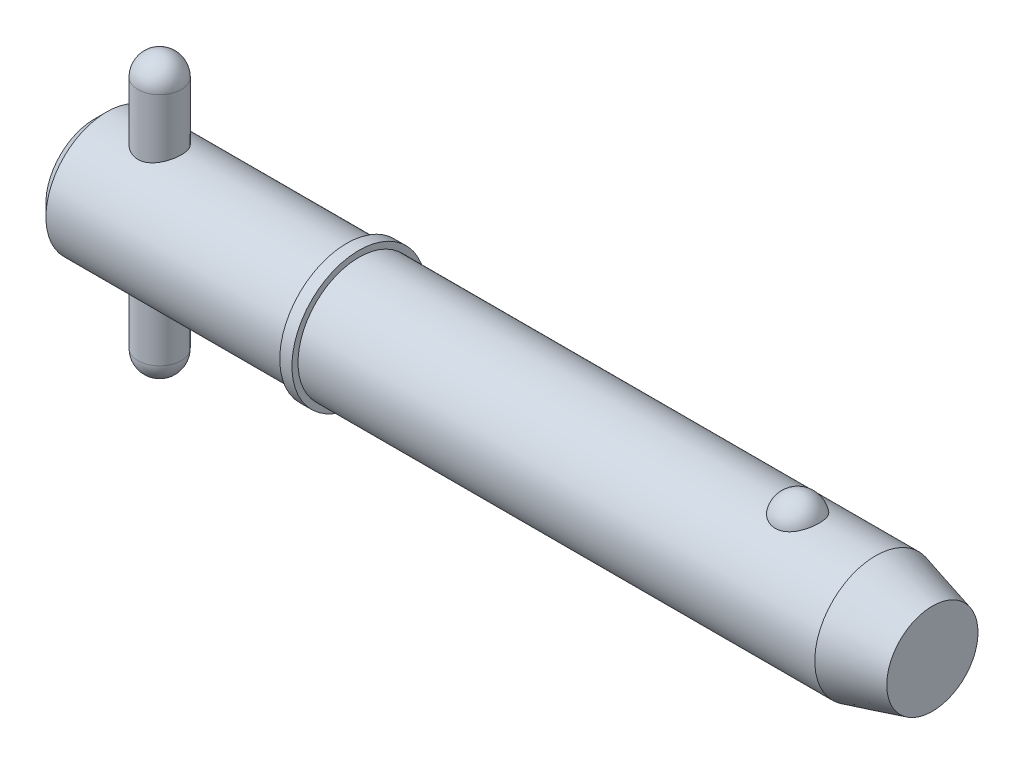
ISO-10303-21;
HEADER;
FILE_DESCRIPTION(('STEP AP214'),'2;1');
FILE_NAME('part.step','',(''),(''),'','','');
FILE_SCHEMA(('AUTOMOTIVE_DESIGN { 1 0 10303 214 1 1 1 1 }'));
ENDSEC;
DATA;
#1=APPLICATION_CONTEXT('core data for automotive mechanical design processes');
#2=APPLICATION_PROTOCOL_DEFINITION('international standard','automotive_design',2000,#1);
#3=PRODUCT_CONTEXT('',#1,'mechanical');
#4=PRODUCT('Part','Part','',(#3));
#5=PRODUCT_RELATED_PRODUCT_CATEGORY('part','',(#4));
#6=PRODUCT_DEFINITION_FORMATION('','',#4);
#7=PRODUCT_DEFINITION_CONTEXT('part definition',#1,'design');
#8=PRODUCT_DEFINITION('design','',#6,#7);
#9=PRODUCT_DEFINITION_SHAPE('','',#8);
#10=(LENGTH_UNIT() NAMED_UNIT(*) SI_UNIT(.MILLI.,.METRE.));
#11=(NAMED_UNIT(*) PLANE_ANGLE_UNIT() SI_UNIT($,.RADIAN.));
#12=(NAMED_UNIT(*) SI_UNIT($,.STERADIAN.) SOLID_ANGLE_UNIT());
#13=UNCERTAINTY_MEASURE_WITH_UNIT(LENGTH_MEASURE(1.E-05),#10,'distance_accuracy_value','');
#14=(GEOMETRIC_REPRESENTATION_CONTEXT(3) GLOBAL_UNCERTAINTY_ASSIGNED_CONTEXT((#13)) GLOBAL_UNIT_ASSIGNED_CONTEXT((#10,
#11,#12)) REPRESENTATION_CONTEXT('',''));
#15=CARTESIAN_POINT('',(0.,0.,0.));
#16=DIRECTION('',(0.,0.,1.));
#17=DIRECTION('',(1.,0.,0.));
#18=AXIS2_PLACEMENT_3D('',#15,#16,#17);
#19=CARTESIAN_POINT('',(5.94,12.7,0.));
#20=DIRECTION('',(0.,-1.,0.));
#21=DIRECTION('',(0.,0.,-1.));
#22=AXIS2_PLACEMENT_3D('',#19,#20,#21);
#23=CYLINDRICAL_SURFACE('',#22,1.98);
#24=CARTESIAN_POINT('',(5.94,-10.72,0.));
#25=DIRECTION('',(0.,-1.,0.));
#26=DIRECTION('',(0.,0.,-1.));
#27=AXIS2_PLACEMENT_3D('',#24,#25,#26);
#28=CIRCLE('',#27,1.98);
#29=CARTESIAN_POINT('',(5.94,-10.72,-1.98));
#30=VERTEX_POINT('',#29);
#31=EDGE_CURVE('P0_E10',#30,#30,#28,.F.);
#32=ORIENTED_EDGE('',*,*,#31,.T.);
#33=EDGE_LOOP('',(#32));
#34=FACE_BOUND('',#33,.T.);
#35=CARTESIAN_POINT('',(5.94,10.72,0.));
#36=DIRECTION('',(0.,-1.,0.));
#37=DIRECTION('',(0.,0.,-1.));
#38=AXIS2_PLACEMENT_3D('',#35,#36,#37);
#39=CIRCLE('',#38,1.98);
#40=CARTESIAN_POINT('',(5.94,10.72,-1.98));
#41=VERTEX_POINT('',#40);
#42=EDGE_CURVE('P0_E21',#41,#41,#39,.T.);
#43=ORIENTED_EDGE('',*,*,#42,.T.);
#44=EDGE_LOOP('',(#43));
#45=FACE_BOUND('',#44,.T.);
#46=ADVANCED_FACE('P0_F14',(#34,#45),#23,.T.);
#47=CARTESIAN_POINT('',(5.94,-10.72,0.));
#48=DIRECTION('',(0.,0.,1.));
#49=DIRECTION('',(1.,0.,0.));
#50=AXIS2_PLACEMENT_3D('',#47,#48,#49);
#51=SPHERICAL_SURFACE('',#50,1.98);
#52=CARTESIAN_POINT('',(5.94,-10.72,0.));
#53=DIRECTION('',(0.,-1.,0.));
#54=DIRECTION('',(0.,0.,-1.));
#55=AXIS2_PLACEMENT_3D('',#52,#53,#54);
#56=SPHERICAL_SURFACE('',#55,1.98);
#57=ORIENTED_EDGE('',*,*,#31,.F.);
#58=EDGE_LOOP('',(#57));
#59=FACE_BOUND('',#58,.T.);
#60=ADVANCED_FACE('P0_F29',(#59),#56,.T.);
#61=CARTESIAN_POINT('',(5.94,10.72,0.));
#62=DIRECTION('',(0.,0.,1.));
#63=DIRECTION('',(1.,0.,0.));
#64=AXIS2_PLACEMENT_3D('',#61,#62,#63);
#65=SPHERICAL_SURFACE('',#64,1.98);
#66=CARTESIAN_POINT('',(5.94,10.72,0.));
#67=DIRECTION('',(0.,-1.,0.));
#68=DIRECTION('',(0.,0.,-1.));
#69=AXIS2_PLACEMENT_3D('',#66,#67,#68);
#70=SPHERICAL_SURFACE('',#69,1.98);
#71=ORIENTED_EDGE('',*,*,#42,.F.);
#72=EDGE_LOOP('',(#71));
#73=FACE_BOUND('',#72,.T.);
#74=ADVANCED_FACE('P0_F16',(#73),#70,.T.);
#75=CLOSED_SHELL('',(#46,#60,#74));
#76=MANIFOLD_SOLID_BREP('P0_B1',#75);
#77=CARTESIAN_POINT('',(0.,0.,0.));
#78=DIRECTION('',(1.,0.,0.));
#79=DIRECTION('',(0.,0.,-1.));
#80=AXIS2_PLACEMENT_3D('',#77,#78,#79);
#81=CYLINDRICAL_SURFACE('',#80,5.555);
#82=CARTESIAN_POINT('',(71.3171144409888,0.,0.));
#83=DIRECTION('',(1.,0.,0.));
#84=DIRECTION('',(0.,0.,-1.));
#85=AXIS2_PLACEMENT_3D('',#82,#83,#84);
#86=CIRCLE('',#85,5.555);
#87=CARTESIAN_POINT('',(71.3171144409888,0.,-5.555));
#88=VERTEX_POINT('',#87);
#89=EDGE_CURVE('P1_E81',#88,#88,#86,.T.);
#90=ORIENTED_EDGE('',*,*,#89,.F.);
#91=EDGE_LOOP('',(#90));
#92=FACE_BOUND('',#91,.T.);
#93=CARTESIAN_POINT('',(24.13,0.,0.));
#94=DIRECTION('',(1.,0.,0.));
#95=DIRECTION('',(0.,0.,-1.));
#96=AXIS2_PLACEMENT_3D('',#93,#94,#95);
#97=CIRCLE('',#96,5.555);
#98=CARTESIAN_POINT('',(24.13,0.,-5.555));
#99=VERTEX_POINT('',#98);
#100=EDGE_CURVE('P1_E85',#99,#99,#97,.T.);
#101=ORIENTED_EDGE('',*,*,#100,.T.);
#102=EDGE_LOOP('',(#101));
#103=FACE_BOUND('',#102,.T.);
#104=CARTESIAN_POINT('',(64.1986264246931,5.16741224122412,2.03859650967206));
#105=CARTESIAN_POINT('',(64.0929492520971,5.16740893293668,2.03859990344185));
#106=CARTESIAN_POINT('',(63.98729894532,5.17079470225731,2.03008306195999));
#107=CARTESIAN_POINT('',(63.7791419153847,5.18392795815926,1.99630721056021));
#108=CARTESIAN_POINT('',(63.6766344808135,5.19367399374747,1.97105201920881));
#109=CARTESIAN_POINT('',(63.4777710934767,5.21839168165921,1.90463997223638));
#110=CARTESIAN_POINT('',(63.3814064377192,5.23335573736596,1.86350622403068));
#111=CARTESIAN_POINT('',(63.1970804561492,5.26688076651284,1.76652592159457));
#112=CARTESIAN_POINT('',(63.1091207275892,5.28544242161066,1.71067657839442));
#113=CARTESIAN_POINT('',(62.941265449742,5.32479845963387,1.58399959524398));
#114=CARTESIAN_POINT('',(62.8616656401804,5.34564089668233,1.5127954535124));
#115=CARTESIAN_POINT('',(62.7151290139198,5.38697258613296,1.3582858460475));
#116=CARTESIAN_POINT('',(62.648194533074,5.40746177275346,1.27497815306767));
#117=CARTESIAN_POINT('',(62.5256103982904,5.44694508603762,1.09440293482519));
#118=CARTESIAN_POINT('',(62.4705989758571,5.46583143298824,0.996677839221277));
#119=CARTESIAN_POINT('',(62.3769376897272,5.49908030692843,0.79296193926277));
#120=CARTESIAN_POINT('',(62.3382894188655,5.513442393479,0.686970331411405));
#121=CARTESIAN_POINT('',(62.2776807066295,5.536358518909,0.468019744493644));
#122=CARTESIAN_POINT('',(62.2559725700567,5.54482455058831,0.354981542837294));
#123=CARTESIAN_POINT('',(62.2306362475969,5.55473324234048,0.126595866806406));
#124=CARTESIAN_POINT('',(62.2270077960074,5.55617600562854,0.0112484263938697));
#125=CARTESIAN_POINT('',(62.2378817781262,5.55189984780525,-0.218011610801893));
#126=CARTESIAN_POINT('',(62.2523151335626,5.54620821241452,-0.331928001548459));
#127=CARTESIAN_POINT('',(62.298903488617,5.52828920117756,-0.555544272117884));
#128=CARTESIAN_POINT('',(62.3310588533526,5.51606169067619,-0.665244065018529));
#129=CARTESIAN_POINT('',(62.4124883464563,5.48630779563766,-0.877469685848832));
#130=CARTESIAN_POINT('',(62.4617816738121,5.4687754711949,-0.97998731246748));
#131=CARTESIAN_POINT('',(62.5764785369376,5.43024700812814,-1.1748697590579));
#132=CARTESIAN_POINT('',(62.6418831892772,5.4092506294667,-1.26723387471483));
#133=CARTESIAN_POINT('',(62.7875712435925,5.36600927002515,-1.43940133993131));
#134=CARTESIAN_POINT('',(62.8678859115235,5.34376173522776,-1.51917763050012));
#135=CARTESIAN_POINT('',(63.0414520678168,5.30057971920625,-1.66360338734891));
#136=CARTESIAN_POINT('',(63.134702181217,5.27964509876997,-1.72825445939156));
#137=CARTESIAN_POINT('',(63.3293939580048,5.24205250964,-1.83909478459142));
#138=CARTESIAN_POINT('',(63.4305900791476,5.22530519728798,-1.88568407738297));
#139=CARTESIAN_POINT('',(63.6401552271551,5.19750919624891,-1.96100802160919));
#140=CARTESIAN_POINT('',(63.7485215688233,5.1864583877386,-1.98974931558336));
#141=CARTESIAN_POINT('',(63.9634989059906,5.17184410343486,-2.02742262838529));
#142=CARTESIAN_POINT('',(64.069925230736,5.1679328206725,-2.03727608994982));
#143=CARTESIAN_POINT('',(64.2829925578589,5.16698995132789,-2.03966777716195));
#144=CARTESIAN_POINT('',(64.3896335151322,5.16995704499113,-2.03220932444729));
#145=CARTESIAN_POINT('',(64.5967730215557,5.18222383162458,-2.00071170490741));
#146=CARTESIAN_POINT('',(64.6973599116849,5.19133213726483,-1.97717337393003));
#147=CARTESIAN_POINT('',(64.8930141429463,5.21467637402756,-1.91475248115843));
#148=CARTESIAN_POINT('',(64.9880810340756,5.22891272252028,-1.8758686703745));
#149=CARTESIAN_POINT('',(65.1723711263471,5.26137066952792,-1.78282713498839));
#150=CARTESIAN_POINT('',(65.2614190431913,5.27967329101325,-1.72835124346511));
#151=CARTESIAN_POINT('',(65.4292880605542,5.31817411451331,-1.60597483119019));
#152=CARTESIAN_POINT('',(65.5081068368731,5.33837274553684,-1.53807126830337));
#153=CARTESIAN_POINT('',(65.6575156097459,5.37968287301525,-1.38688970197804));
#154=CARTESIAN_POINT('',(65.7275058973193,5.40079011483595,-1.30301744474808));
#155=CARTESIAN_POINT('',(65.8530125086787,5.44074401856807,-1.12458170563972));
#156=CARTESIAN_POINT('',(65.9085262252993,5.4595902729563,-1.03001630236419));
#157=CARTESIAN_POINT('',(66.0055507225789,5.49369849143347,-0.829439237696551));
#158=CARTESIAN_POINT('',(66.0465483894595,5.50882422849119,-0.723155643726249));
#159=CARTESIAN_POINT('',(66.1111250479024,5.53310911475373,-0.504772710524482));
#160=CARTESIAN_POINT('',(66.1347036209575,5.54226812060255,-0.392673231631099));
#161=CARTESIAN_POINT('',(66.164013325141,5.55370358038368,-0.165459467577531));
#162=CARTESIAN_POINT('',(66.1696884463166,5.55595843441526,-0.0503368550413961));
#163=CARTESIAN_POINT('',(66.162916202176,5.55329317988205,0.179288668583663));
#164=CARTESIAN_POINT('',(66.1504690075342,5.54837313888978,0.293791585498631));
#165=CARTESIAN_POINT('',(66.1077798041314,5.53189037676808,0.51852641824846));
#166=CARTESIAN_POINT('',(66.077598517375,5.5203503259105,0.628771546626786));
#167=CARTESIAN_POINT('',(66.0000962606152,5.49182453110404,0.842318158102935));
#168=CARTESIAN_POINT('',(65.9527743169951,5.47483847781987,0.945619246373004));
#169=CARTESIAN_POINT('',(65.8417204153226,5.43710633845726,1.14281571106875));
#170=CARTESIAN_POINT('',(65.777921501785,5.41634501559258,1.23667048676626));
#171=CARTESIAN_POINT('',(65.6353577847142,5.37334572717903,1.41185243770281));
#172=CARTESIAN_POINT('',(65.5565932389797,5.35110778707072,1.4931798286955));
#173=CARTESIAN_POINT('',(65.3864234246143,5.30779474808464,1.64049162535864));
#174=CARTESIAN_POINT('',(65.2951002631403,5.28671324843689,1.7065687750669));
#175=CARTESIAN_POINT('',(65.1017390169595,5.24804852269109,1.82201372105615));
#176=CARTESIAN_POINT('',(64.9997005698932,5.23046541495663,1.87138095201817));
#177=CARTESIAN_POINT('',(64.7836187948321,5.20042692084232,1.95335298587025));
#178=CARTESIAN_POINT('',(64.669260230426,5.18820192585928,1.98521734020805));
#179=CARTESIAN_POINT('',(64.4361307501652,5.17169804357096,2.02783294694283));
#180=CARTESIAN_POINT('',(64.3173616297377,5.16741595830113,2.03859269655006));
#181=CARTESIAN_POINT('',(64.1986264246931,5.16741224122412,2.03859650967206));
#182=B_SPLINE_CURVE_WITH_KNOTS('',3,(#104,#105,#106,#107,#108,#109,#110,#111,#112,#113,#114,
#115,#116,#117,#118,#119,#120,#121,#122,#123,#124,#125,#126,#127,#128,#129,#130,#131,#132,#133,
#134,#135,#136,#137,#138,#139,#140,#141,#142,#143,#144,#145,#146,#147,#148,#149,#150,#151,#152,
#153,#154,#155,#156,#157,#158,#159,#160,#161,#162,#163,#164,#165,#166,#167,#168,#169,#170,#171,
#172,#173,#174,#175,#176,#177,#178,#179,#180,#181),.UNSPECIFIED.,.T.,.F.,(4,2,2,2,2,2,2,2,2,2,2,
2,2,2,2,2,2,2,2,2,2,2,2,2,2,2,2,2,2,2,2,2,2,2,2,2,2,2,4),(0.,0.316595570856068,
0.633118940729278,0.949183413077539,1.26530783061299,1.59030762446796,1.91536729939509,
2.25495824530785,2.59458224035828,2.93917283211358,3.28375835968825,3.62703002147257,
3.97030875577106,4.31397329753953,4.657661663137,5.00207904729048,5.34645984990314,
5.68270547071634,6.01882587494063,6.33808403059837,6.65728093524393,6.96696376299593,
7.27667180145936,7.59321535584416,7.90983070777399,8.24210387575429,8.5744368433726,
8.9175589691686,9.26068933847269,9.60489211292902,9.94909164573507,10.2921194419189,
10.6351667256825,10.9796305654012,11.3240884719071,11.6663928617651,12.0087088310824,
12.3645679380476,12.7202837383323),.UNSPECIFIED.);
#183=CARTESIAN_POINT('',(64.1986264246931,5.16741224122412,2.03859650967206));
#184=VERTEX_POINT('',#183);
#185=EDGE_CURVE('P1_E35',#184,#184,#182,.T.);
#186=ORIENTED_EDGE('',*,*,#185,.T.);
#187=EDGE_LOOP('',(#186));
#188=FACE_BOUND('',#187,.T.);
#189=ADVANCED_FACE('P1_F13',(#92,#103,#188),#81,.T.);
#190=CARTESIAN_POINT('',(0.,0.,0.));
#191=DIRECTION('',(-1.,0.,0.));
#192=DIRECTION('',(0.,0.,1.));
#193=AXIS2_PLACEMENT_3D('',#190,#191,#192);
#194=PLANE('',#193);
#195=CARTESIAN_POINT('',(0.,0.,0.));
#196=DIRECTION('',(1.,0.,0.));
#197=DIRECTION('',(0.,0.,-1.));
#198=AXIS2_PLACEMENT_3D('',#195,#196,#197);
#199=CIRCLE('',#198,4.444);
#200=CARTESIAN_POINT('',(0.,0.,-4.444));
#201=VERTEX_POINT('',#200);
#202=EDGE_CURVE('P1_E9',#201,#201,#199,.T.);
#203=ORIENTED_EDGE('',*,*,#202,.F.);
#204=EDGE_LOOP('',(#203));
#205=FACE_BOUND('',#204,.T.);
#206=ADVANCED_FACE('P1_F15',(#205),#194,.T.);
#207=CARTESIAN_POINT('',(1.111,0.,0.));
#208=DIRECTION('',(1.,0.,0.));
#209=DIRECTION('',(0.,0.,-1.));
#210=AXIS2_PLACEMENT_3D('',#207,#208,#209);
#211=CONICAL_SURFACE('',#210,5.555,0.78539816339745);
#212=ORIENTED_EDGE('',*,*,#202,.T.);
#213=EDGE_LOOP('',(#212));
#214=FACE_BOUND('',#213,.T.);
#215=CARTESIAN_POINT('',(1.111,0.,0.));
#216=DIRECTION('',(1.,0.,0.));
#217=DIRECTION('',(0.,0.,-1.));
#218=AXIS2_PLACEMENT_3D('',#215,#216,#217);
#219=CIRCLE('',#218,5.555);
#220=CARTESIAN_POINT('',(1.111,0.,-5.555));
#221=VERTEX_POINT('',#220);
#222=EDGE_CURVE('P1_E26',#221,#221,#219,.T.);
#223=ORIENTED_EDGE('',*,*,#222,.F.);
#224=EDGE_LOOP('',(#223));
#225=FACE_BOUND('',#224,.T.);
#226=ADVANCED_FACE('P1_F77',(#214,#225),#211,.T.);
#227=CARTESIAN_POINT('',(0.,0.,0.));
#228=DIRECTION('',(1.,0.,0.));
#229=DIRECTION('',(0.,0.,-1.));
#230=AXIS2_PLACEMENT_3D('',#227,#228,#229);
#231=CYLINDRICAL_SURFACE('',#230,5.555);
#232=CARTESIAN_POINT('',(5.94,-5.19014691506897,1.98));
#233=CARTESIAN_POINT('',(5.83264687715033,-5.19014494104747,1.98000226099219));
#234=CARTESIAN_POINT('',(5.7253094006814,-5.19351395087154,1.97123988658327));
#235=CARTESIAN_POINT('',(5.51384517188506,-5.20654291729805,1.93656219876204));
#236=CARTESIAN_POINT('',(5.40971858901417,-5.21620320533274,1.91064598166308));
#237=CARTESIAN_POINT('',(5.20778082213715,-5.24058443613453,1.84271148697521));
#238=CARTESIAN_POINT('',(5.10995634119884,-5.25529427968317,1.80072850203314));
#239=CARTESIAN_POINT('',(4.92270352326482,-5.28810012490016,1.70197537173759));
#240=CARTESIAN_POINT('',(4.83327743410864,-5.3061970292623,1.64520128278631));
#241=CARTESIAN_POINT('',(4.66135184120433,-5.34464714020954,1.51575187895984));
#242=CARTESIAN_POINT('',(4.57928277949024,-5.36506222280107,1.44252311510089));
#243=CARTESIAN_POINT('',(4.42829115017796,-5.40532920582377,1.28342047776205));
#244=CARTESIAN_POINT('',(4.35937105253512,-5.42518099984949,1.19754423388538));
#245=CARTESIAN_POINT('',(4.23461605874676,-5.46281133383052,1.01237205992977));
#246=CARTESIAN_POINT('',(4.17924129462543,-5.48050875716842,0.912748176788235));
#247=CARTESIAN_POINT('',(4.0862117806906,-5.51109938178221,0.70485824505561));
#248=CARTESIAN_POINT('',(4.0485515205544,-5.52399407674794,0.596594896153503));
#249=CARTESIAN_POINT('',(3.99350662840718,-5.54308759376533,0.379019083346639));
#250=CARTESIAN_POINT('',(3.97538263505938,-5.54952987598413,0.269915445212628));
#251=CARTESIAN_POINT('',(3.95756405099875,-5.55586205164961,0.0500378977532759));
#252=CARTESIAN_POINT('',(3.95786404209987,-5.55575387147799,-0.060735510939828));
#253=CARTESIAN_POINT('',(3.97643665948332,-5.54915684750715,-0.275539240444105));
#254=CARTESIAN_POINT('',(3.99390415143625,-5.54295384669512,-0.379649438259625));
#255=CARTESIAN_POINT('',(4.0449721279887,-5.52523170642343,-0.583350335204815));
#256=CARTESIAN_POINT('',(4.07857373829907,-5.51371219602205,-0.682940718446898));
#257=CARTESIAN_POINT('',(4.16137312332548,-5.4863099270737,-0.876423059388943));
#258=CARTESIAN_POINT('',(4.2107826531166,-5.47036834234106,-0.970215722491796));
#259=CARTESIAN_POINT('',(4.32361427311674,-5.43575653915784,-1.1484017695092));
#260=CARTESIAN_POINT('',(4.38704062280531,-5.41708549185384,-1.23279228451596));
#261=CARTESIAN_POINT('',(4.53006791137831,-5.37778429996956,-1.39454579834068));
#262=CARTESIAN_POINT('',(4.61035105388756,-5.35710277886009,-1.4712940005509));
#263=CARTESIAN_POINT('',(4.78279835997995,-5.31692766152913,-1.6104545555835));
#264=CARTESIAN_POINT('',(4.874964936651,-5.29743430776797,-1.67286398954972));
#265=CARTESIAN_POINT('',(5.07076688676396,-5.26153775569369,-1.78259698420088));
#266=CARTESIAN_POINT('',(5.17458163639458,-5.24519780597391,-1.8296227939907));
#267=CARTESIAN_POINT('',(5.38938990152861,-5.21818744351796,-1.90530278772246));
#268=CARTESIAN_POINT('',(5.50037985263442,-5.20751423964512,-1.93396601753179));
#269=CARTESIAN_POINT('',(5.72036376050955,-5.19369176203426,-1.97077654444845));
#270=CARTESIAN_POINT('',(5.82917370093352,-5.19018851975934,-1.97989015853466));
#271=CARTESIAN_POINT('',(6.04680100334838,-5.19010609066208,-1.98010779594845));
#272=CARTESIAN_POINT('',(6.15561835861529,-5.19352540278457,-1.97121572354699));
#273=CARTESIAN_POINT('',(6.36548036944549,-5.20654623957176,-1.93654727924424));
#274=CARTESIAN_POINT('',(6.46666051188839,-5.21588705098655,-1.91148218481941));
#275=CARTESIAN_POINT('',(6.66334537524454,-5.23939939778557,-1.84605494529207));
#276=CARTESIAN_POINT('',(6.75884899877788,-5.25357186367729,-1.8056898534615));
#277=CARTESIAN_POINT('',(6.94517989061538,-5.28576258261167,-1.70921153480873));
#278=CARTESIAN_POINT('',(7.03572661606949,-5.30389804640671,-1.65259670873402));
#279=CARTESIAN_POINT('',(7.20638087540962,-5.34176077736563,-1.52577523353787));
#280=CARTESIAN_POINT('',(7.28648490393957,-5.36148857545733,-1.45556404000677));
#281=CARTESIAN_POINT('',(7.43864697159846,-5.40165494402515,-1.2988614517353));
#282=CARTESIAN_POINT('',(7.50999887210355,-5.42207106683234,-1.21167640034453));
#283=CARTESIAN_POINT('',(7.63712639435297,-5.46023601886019,-1.026066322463));
#284=CARTESIAN_POINT('',(7.69290228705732,-5.47798489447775,-0.927641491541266));
#285=CARTESIAN_POINT('',(7.78684673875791,-5.50876590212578,-0.722633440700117));
#286=CARTESIAN_POINT('',(7.82510508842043,-5.52182201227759,-0.616095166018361));
#287=CARTESIAN_POINT('',(7.88297051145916,-5.54184206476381,-0.397530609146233));
#288=CARTESIAN_POINT('',(7.90258540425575,-5.5488085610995,-0.285506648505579));
#289=CARTESIAN_POINT('',(7.9218262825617,-5.55564472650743,-0.065566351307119));
#290=CARTESIAN_POINT('',(7.92245987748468,-5.55587212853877,0.0422515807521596));
#291=CARTESIAN_POINT('',(7.90626329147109,-5.55011340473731,0.256387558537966));
#292=CARTESIAN_POINT('',(7.88943488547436,-5.54412791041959,0.362705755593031));
#293=CARTESIAN_POINT('',(7.83948457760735,-5.52676548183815,0.568649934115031));
#294=CARTESIAN_POINT('',(7.8067003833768,-5.51550046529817,0.668367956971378));
#295=CARTESIAN_POINT('',(7.72609369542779,-5.48874437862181,0.860911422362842));
#296=CARTESIAN_POINT('',(7.67826838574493,-5.47325251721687,0.953735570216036));
#297=CARTESIAN_POINT('',(7.56675024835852,-5.43884382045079,1.13391068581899));
#298=CARTESIAN_POINT('',(7.50249968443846,-5.41981485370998,1.22089468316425));
#299=CARTESIAN_POINT('',(7.36086495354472,-5.38069275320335,1.38316665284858));
#300=CARTESIAN_POINT('',(7.28347630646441,-5.36059925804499,1.45845061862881));
#301=CARTESIAN_POINT('',(7.11347587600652,-5.32048380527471,1.59876646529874));
#302=CARTESIAN_POINT('',(7.02032386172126,-5.30050854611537,1.66315951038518));
#303=CARTESIAN_POINT('',(6.82388804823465,-5.26398994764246,1.77536801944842));
#304=CARTESIAN_POINT('',(6.7206049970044,-5.24744635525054,1.82318470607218));
#305=CARTESIAN_POINT('',(6.50639706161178,-5.21987969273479,1.90068230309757));
#306=CARTESIAN_POINT('',(6.3954529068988,-5.20887116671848,1.93031547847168));
#307=CARTESIAN_POINT('',(6.16966522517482,-5.19400760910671,1.96996824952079));
#308=CARTESIAN_POINT('',(6.05482366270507,-5.19014902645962,1.97999758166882));
#309=CARTESIAN_POINT('',(5.94,-5.19014691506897,1.98));
#310=B_SPLINE_CURVE_WITH_KNOTS('',3,(#232,#233,#234,#235,#236,#237,#238,#239,#240,#241,#242,
#243,#244,#245,#246,#247,#248,#249,#250,#251,#252,#253,#254,#255,#256,#257,#258,#259,#260,#261,
#262,#263,#264,#265,#266,#267,#268,#269,#270,#271,#272,#273,#274,#275,#276,#277,#278,#279,#280,
#281,#282,#283,#284,#285,#286,#287,#288,#289,#290,#291,#292,#293,#294,#295,#296,#297,#298,#299,
#300,#301,#302,#303,#304,#305,#306,#307,#308,#309),.UNSPECIFIED.,.T.,.F.,(4,2,2,2,2,2,2,2,2,2,2,
2,2,2,2,2,2,2,2,2,2,2,2,2,2,2,2,2,2,2,2,2,2,2,2,2,2,2,4),(0.,0.321632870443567,
0.643282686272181,0.964229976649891,1.28526292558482,1.61937087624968,1.9535415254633,
2.29784481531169,2.64204093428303,2.97269632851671,3.30325448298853,3.61901541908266,
3.93479838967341,4.25500220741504,4.57530346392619,4.91268648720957,5.25013812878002,
5.59378026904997,5.93725299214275,6.26331481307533,6.58930593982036,6.90185604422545,
7.21446637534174,7.53801472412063,7.86167140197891,8.20353561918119,8.54539388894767,
8.88547970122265,9.22542281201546,9.54728637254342,9.86911722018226,10.1844146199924,
10.4997710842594,10.827730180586,11.1558013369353,11.499115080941,11.8424034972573,
12.1865892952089,12.5306041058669),.UNSPECIFIED.);
#311=CARTESIAN_POINT('',(5.94,-5.19014691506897,1.98));
#312=VERTEX_POINT('',#311);
#313=EDGE_CURVE('P1_E17',#312,#312,#310,.T.);
#314=ORIENTED_EDGE('',*,*,#313,.F.);
#315=EDGE_LOOP('',(#314));
#316=FACE_BOUND('',#315,.T.);
#317=CARTESIAN_POINT('',(5.94,5.19014691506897,1.98));
#318=CARTESIAN_POINT('',(6.04735312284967,5.19014494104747,1.98000226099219));
#319=CARTESIAN_POINT('',(6.1546905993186,5.19351395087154,1.97123988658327));
#320=CARTESIAN_POINT('',(6.36615482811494,5.20654291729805,1.93656219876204));
#321=CARTESIAN_POINT('',(6.47028141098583,5.21620320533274,1.91064598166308));
#322=CARTESIAN_POINT('',(6.67221917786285,5.24058443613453,1.84271148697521));
#323=CARTESIAN_POINT('',(6.77004365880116,5.25529427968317,1.80072850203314));
#324=CARTESIAN_POINT('',(6.95729647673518,5.28810012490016,1.70197537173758));
#325=CARTESIAN_POINT('',(7.04672256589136,5.3061970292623,1.64520128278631));
#326=CARTESIAN_POINT('',(7.21864815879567,5.34464714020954,1.51575187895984));
#327=CARTESIAN_POINT('',(7.30071722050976,5.36506222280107,1.44252311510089));
#328=CARTESIAN_POINT('',(7.45170884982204,5.40532920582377,1.28342047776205));
#329=CARTESIAN_POINT('',(7.52062894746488,5.42518099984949,1.19754423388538));
#330=CARTESIAN_POINT('',(7.64538394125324,5.46281133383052,1.01237205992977));
#331=CARTESIAN_POINT('',(7.70075870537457,5.48050875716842,0.912748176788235));
#332=CARTESIAN_POINT('',(7.7937882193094,5.51109938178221,0.704858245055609));
#333=CARTESIAN_POINT('',(7.8314484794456,5.52399407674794,0.596594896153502));
#334=CARTESIAN_POINT('',(7.88649337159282,5.54308759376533,0.379019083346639));
#335=CARTESIAN_POINT('',(7.90461736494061,5.54952987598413,0.269915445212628));
#336=CARTESIAN_POINT('',(7.92243594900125,5.55586205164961,0.0500378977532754));
#337=CARTESIAN_POINT('',(7.92213595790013,5.55575387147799,-0.0607355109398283));
#338=CARTESIAN_POINT('',(7.90356334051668,5.54915684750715,-0.275539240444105));
#339=CARTESIAN_POINT('',(7.88609584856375,5.54295384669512,-0.379649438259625));
#340=CARTESIAN_POINT('',(7.8350278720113,5.52523170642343,-0.583350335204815));
#341=CARTESIAN_POINT('',(7.80142626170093,5.51371219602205,-0.682940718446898));
#342=CARTESIAN_POINT('',(7.71862687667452,5.4863099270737,-0.876423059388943));
#343=CARTESIAN_POINT('',(7.6692173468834,5.47036834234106,-0.970215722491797));
#344=CARTESIAN_POINT('',(7.55638572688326,5.43575653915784,-1.1484017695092));
#345=CARTESIAN_POINT('',(7.49295937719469,5.41708549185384,-1.23279228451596));
#346=CARTESIAN_POINT('',(7.34993208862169,5.37778429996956,-1.39454579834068));
#347=CARTESIAN_POINT('',(7.26964894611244,5.35710277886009,-1.4712940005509));
#348=CARTESIAN_POINT('',(7.09720164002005,5.31692766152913,-1.6104545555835));
#349=CARTESIAN_POINT('',(7.00503506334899,5.29743430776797,-1.67286398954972));
#350=CARTESIAN_POINT('',(6.80923311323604,5.26153775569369,-1.78259698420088));
#351=CARTESIAN_POINT('',(6.70541836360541,5.24519780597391,-1.8296227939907));
#352=CARTESIAN_POINT('',(6.49061009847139,5.21818744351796,-1.90530278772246));
#353=CARTESIAN_POINT('',(6.37962014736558,5.20751423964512,-1.93396601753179));
#354=CARTESIAN_POINT('',(6.15963623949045,5.19369176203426,-1.97077654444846));
#355=CARTESIAN_POINT('',(6.05082629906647,5.19018851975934,-1.97989015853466));
#356=CARTESIAN_POINT('',(5.83319899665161,5.19010609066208,-1.98010779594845));
#357=CARTESIAN_POINT('',(5.7243816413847,5.19352540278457,-1.97121572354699));
#358=CARTESIAN_POINT('',(5.5145196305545,5.20654623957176,-1.93654727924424));
#359=CARTESIAN_POINT('',(5.4133394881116,5.21588705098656,-1.91148218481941));
#360=CARTESIAN_POINT('',(5.21665462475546,5.23939939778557,-1.84605494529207));
#361=CARTESIAN_POINT('',(5.12115100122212,5.25357186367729,-1.8056898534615));
#362=CARTESIAN_POINT('',(4.93482010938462,5.28576258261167,-1.70921153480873));
#363=CARTESIAN_POINT('',(4.84427338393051,5.30389804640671,-1.65259670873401));
#364=CARTESIAN_POINT('',(4.67361912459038,5.34176077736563,-1.52577523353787));
#365=CARTESIAN_POINT('',(4.59351509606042,5.36148857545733,-1.45556404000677));
#366=CARTESIAN_POINT('',(4.44135302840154,5.40165494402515,-1.2988614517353));
#367=CARTESIAN_POINT('',(4.37000112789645,5.42207106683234,-1.21167640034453));
#368=CARTESIAN_POINT('',(4.24287360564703,5.46023601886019,-1.026066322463));
#369=CARTESIAN_POINT('',(4.18709771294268,5.47798489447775,-0.927641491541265));
#370=CARTESIAN_POINT('',(4.09315326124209,5.50876590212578,-0.722633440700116));
#371=CARTESIAN_POINT('',(4.05489491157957,5.52182201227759,-0.61609516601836));
#372=CARTESIAN_POINT('',(3.99702948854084,5.54184206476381,-0.397530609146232));
#373=CARTESIAN_POINT('',(3.97741459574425,5.5488085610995,-0.285506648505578));
#374=CARTESIAN_POINT('',(3.9581737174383,5.55564472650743,-0.0655663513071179));
#375=CARTESIAN_POINT('',(3.95754012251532,5.55587212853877,0.0422515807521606));
#376=CARTESIAN_POINT('',(3.97373670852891,5.55011340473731,0.256387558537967));
#377=CARTESIAN_POINT('',(3.99056511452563,5.54412791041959,0.362705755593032));
#378=CARTESIAN_POINT('',(4.04051542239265,5.52676548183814,0.568649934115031));
#379=CARTESIAN_POINT('',(4.07329961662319,5.51550046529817,0.668367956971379));
#380=CARTESIAN_POINT('',(4.15390630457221,5.48874437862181,0.860911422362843));
#381=CARTESIAN_POINT('',(4.20173161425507,5.47325251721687,0.953735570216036));
#382=CARTESIAN_POINT('',(4.31324975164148,5.43884382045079,1.13391068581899));
#383=CARTESIAN_POINT('',(4.37750031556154,5.41981485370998,1.22089468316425));
#384=CARTESIAN_POINT('',(4.51913504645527,5.38069275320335,1.38316665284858));
#385=CARTESIAN_POINT('',(4.59652369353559,5.36059925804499,1.45845061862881));
#386=CARTESIAN_POINT('',(4.76652412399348,5.32048380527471,1.59876646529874));
#387=CARTESIAN_POINT('',(4.85967613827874,5.30050854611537,1.66315951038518));
#388=CARTESIAN_POINT('',(5.05611195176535,5.26398994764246,1.77536801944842));
#389=CARTESIAN_POINT('',(5.1593950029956,5.24744635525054,1.82318470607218));
#390=CARTESIAN_POINT('',(5.37360293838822,5.21987969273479,1.90068230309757));
#391=CARTESIAN_POINT('',(5.4845470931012,5.20887116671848,1.93031547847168));
#392=CARTESIAN_POINT('',(5.71033477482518,5.19400760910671,1.96996824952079));
#393=CARTESIAN_POINT('',(5.82517633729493,5.19014902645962,1.97999758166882));
#394=CARTESIAN_POINT('',(5.94,5.19014691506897,1.98));
#395=B_SPLINE_CURVE_WITH_KNOTS('',3,(#317,#318,#319,#320,#321,#322,#323,#324,#325,#326,#327,
#328,#329,#330,#331,#332,#333,#334,#335,#336,#337,#338,#339,#340,#341,#342,#343,#344,#345,#346,
#347,#348,#349,#350,#351,#352,#353,#354,#355,#356,#357,#358,#359,#360,#361,#362,#363,#364,#365,
#366,#367,#368,#369,#370,#371,#372,#373,#374,#375,#376,#377,#378,#379,#380,#381,#382,#383,#384,
#385,#386,#387,#388,#389,#390,#391,#392,#393,#394),.UNSPECIFIED.,.T.,.F.,(4,2,2,2,2,2,2,2,2,2,2,
2,2,2,2,2,2,2,2,2,2,2,2,2,2,2,2,2,2,2,2,2,2,2,2,2,2,2,4),(0.,0.321632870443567,
0.643282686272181,0.964229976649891,1.28526292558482,1.61937087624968,1.9535415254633,
2.29784481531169,2.64204093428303,2.97269632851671,3.30325448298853,3.61901541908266,
3.93479838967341,4.25500220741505,4.57530346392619,4.91268648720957,5.25013812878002,
5.59378026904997,5.93725299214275,6.26331481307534,6.58930593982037,6.90185604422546,
7.21446637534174,7.53801472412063,7.86167140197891,8.20353561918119,8.54539388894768,
8.88547970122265,9.22542281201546,9.54728637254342,9.86911722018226,10.1844146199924,
10.4997710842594,10.827730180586,11.1558013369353,11.499115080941,11.8424034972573,
12.1865892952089,12.5306041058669),.UNSPECIFIED.);
#396=CARTESIAN_POINT('',(5.94,5.19014691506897,1.98));
#397=VERTEX_POINT('',#396);
#398=EDGE_CURVE('P1_E43',#397,#397,#395,.T.);
#399=ORIENTED_EDGE('',*,*,#398,.F.);
#400=EDGE_LOOP('',(#399));
#401=FACE_BOUND('',#400,.T.);
#402=ORIENTED_EDGE('',*,*,#222,.T.);
#403=EDGE_LOOP('',(#402));
#404=FACE_BOUND('',#403,.T.);
#405=CARTESIAN_POINT('',(23.019,0.,0.));
#406=DIRECTION('',(1.,0.,0.));
#407=DIRECTION('',(0.,0.,-1.));
#408=AXIS2_PLACEMENT_3D('',#405,#406,#407);
#409=CIRCLE('',#408,5.555);
#410=CARTESIAN_POINT('',(23.019,0.,-5.555));
#411=VERTEX_POINT('',#410);
#412=EDGE_CURVE('P1_E31',#411,#411,#409,.T.);
#413=ORIENTED_EDGE('',*,*,#412,.F.);
#414=EDGE_LOOP('',(#413));
#415=FACE_BOUND('',#414,.T.);
#416=ADVANCED_FACE('P1_F103',(#316,#401,#404,#415),#231,.T.);
#417=CARTESIAN_POINT('',(23.019,5.555,0.));
#418=DIRECTION('',(-1.,0.,0.));
#419=DIRECTION('',(0.,0.,1.));
#420=AXIS2_PLACEMENT_3D('',#417,#418,#419);
#421=PLANE('',#420);
#422=ORIENTED_EDGE('',*,*,#412,.T.);
#423=EDGE_LOOP('',(#422));
#424=FACE_BOUND('',#423,.T.);
#425=CARTESIAN_POINT('',(23.019,0.,0.));
#426=DIRECTION('',(1.,0.,0.));
#427=DIRECTION('',(0.,0.,-1.));
#428=AXIS2_PLACEMENT_3D('',#425,#426,#427);
#429=CIRCLE('',#428,6.1105);
#430=CARTESIAN_POINT('',(23.019,0.,-6.1105));
#431=VERTEX_POINT('',#430);
#432=EDGE_CURVE('P1_E91',#431,#431,#429,.T.);
#433=ORIENTED_EDGE('',*,*,#432,.F.);
#434=EDGE_LOOP('',(#433));
#435=FACE_BOUND('',#434,.T.);
#436=ADVANCED_FACE('P1_F100',(#424,#435),#421,.T.);
#437=CARTESIAN_POINT('',(0.,0.,0.));
#438=DIRECTION('',(1.,0.,0.));
#439=DIRECTION('',(0.,0.,-1.));
#440=AXIS2_PLACEMENT_3D('',#437,#438,#439);
#441=CYLINDRICAL_SURFACE('',#440,6.1105);
#442=ORIENTED_EDGE('',*,*,#432,.T.);
#443=EDGE_LOOP('',(#442));
#444=FACE_BOUND('',#443,.T.);
#445=CARTESIAN_POINT('',(24.13,0.,0.));
#446=DIRECTION('',(1.,0.,0.));
#447=DIRECTION('',(0.,0.,-1.));
#448=AXIS2_PLACEMENT_3D('',#445,#446,#447);
#449=CIRCLE('',#448,6.1105);
#450=CARTESIAN_POINT('',(24.13,0.,-6.1105));
#451=VERTEX_POINT('',#450);
#452=EDGE_CURVE('P1_E88',#451,#451,#449,.T.);
#453=ORIENTED_EDGE('',*,*,#452,.F.);
#454=EDGE_LOOP('',(#453));
#455=FACE_BOUND('',#454,.T.);
#456=ADVANCED_FACE('P1_F68',(#444,#455),#441,.T.);
#457=CARTESIAN_POINT('',(24.13,6.1105,0.));
#458=DIRECTION('',(1.,0.,0.));
#459=DIRECTION('',(0.,0.,-1.));
#460=AXIS2_PLACEMENT_3D('',#457,#458,#459);
#461=PLANE('',#460);
#462=ORIENTED_EDGE('',*,*,#452,.T.);
#463=EDGE_LOOP('',(#462));
#464=FACE_BOUND('',#463,.T.);
#465=ORIENTED_EDGE('',*,*,#100,.F.);
#466=EDGE_LOOP('',(#465));
#467=FACE_BOUND('',#466,.T.);
#468=ADVANCED_FACE('P1_F62',(#464,#467),#461,.T.);
#469=CARTESIAN_POINT('',(76.5,0.,0.));
#470=DIRECTION('',(-1.,0.,0.));
#471=DIRECTION('',(0.,0.,1.));
#472=AXIS2_PLACEMENT_3D('',#469,#470,#471);
#473=CONICAL_SURFACE('',#472,4.16625000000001,0.26179938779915);
#474=ORIENTED_EDGE('',*,*,#89,.T.);
#475=EDGE_LOOP('',(#474));
#476=FACE_BOUND('',#475,.T.);
#477=CARTESIAN_POINT('',(76.5,0.,0.));
#478=DIRECTION('',(1.,0.,0.));
#479=DIRECTION('',(0.,0.,-1.));
#480=AXIS2_PLACEMENT_3D('',#477,#478,#479);
#481=CIRCLE('',#480,4.16625000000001);
#482=CARTESIAN_POINT('',(76.5,0.,-4.16625000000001));
#483=VERTEX_POINT('',#482);
#484=EDGE_CURVE('P1_E42',#483,#483,#481,.T.);
#485=ORIENTED_EDGE('',*,*,#484,.F.);
#486=EDGE_LOOP('',(#485));
#487=FACE_BOUND('',#486,.T.);
#488=ADVANCED_FACE('P1_F59',(#476,#487),#473,.T.);
#489=CARTESIAN_POINT('',(76.5,4.16625000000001,0.));
#490=DIRECTION('',(1.,0.,0.));
#491=DIRECTION('',(0.,0.,-1.));
#492=AXIS2_PLACEMENT_3D('',#489,#490,#491);
#493=PLANE('',#492);
#494=ORIENTED_EDGE('',*,*,#484,.T.);
#495=EDGE_LOOP('',(#494));
#496=FACE_BOUND('',#495,.T.);
#497=ADVANCED_FACE('P1_F55',(#496),#493,.T.);
#498=CARTESIAN_POINT('',(64.1986264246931,4.9995,0.));
#499=DIRECTION('',(-1.,0.,0.));
#500=DIRECTION('',(0.,1.,0.));
#501=AXIS2_PLACEMENT_3D('',#498,#499,#500);
#502=SPHERICAL_SURFACE('',#501,2.0455);
#503=ORIENTED_EDGE('',*,*,#185,.F.);
#504=EDGE_LOOP('',(#503));
#505=FACE_BOUND('',#504,.T.);
#506=ADVANCED_FACE('P1_F50',(#505),#502,.T.);
#507=CARTESIAN_POINT('',(5.94,-6.1105,0.));
#508=DIRECTION('',(0.,1.,0.));
#509=DIRECTION('',(0.,0.,1.));
#510=AXIS2_PLACEMENT_3D('',#507,#508,#509);
#511=CYLINDRICAL_SURFACE('',#510,1.98);
#512=ORIENTED_EDGE('',*,*,#313,.T.);
#513=EDGE_LOOP('',(#512));
#514=FACE_BOUND('',#513,.T.);
#515=ORIENTED_EDGE('',*,*,#398,.T.);
#516=EDGE_LOOP('',(#515));
#517=FACE_BOUND('',#516,.T.);
#518=ADVANCED_FACE('P1_F54',(#514,#517),#511,.F.);
#519=CLOSED_SHELL('',(#189,#206,#226,#416,#436,#456,#468,#488,#497,#506,#518));
#520=MANIFOLD_SOLID_BREP('P1_B1',#519);
#521=ADVANCED_BREP_SHAPE_REPRESENTATION('',(#18,#76,#520),#14);
#522=SHAPE_DEFINITION_REPRESENTATION(#9,#521);
ENDSEC;
END-ISO-10303-21;
